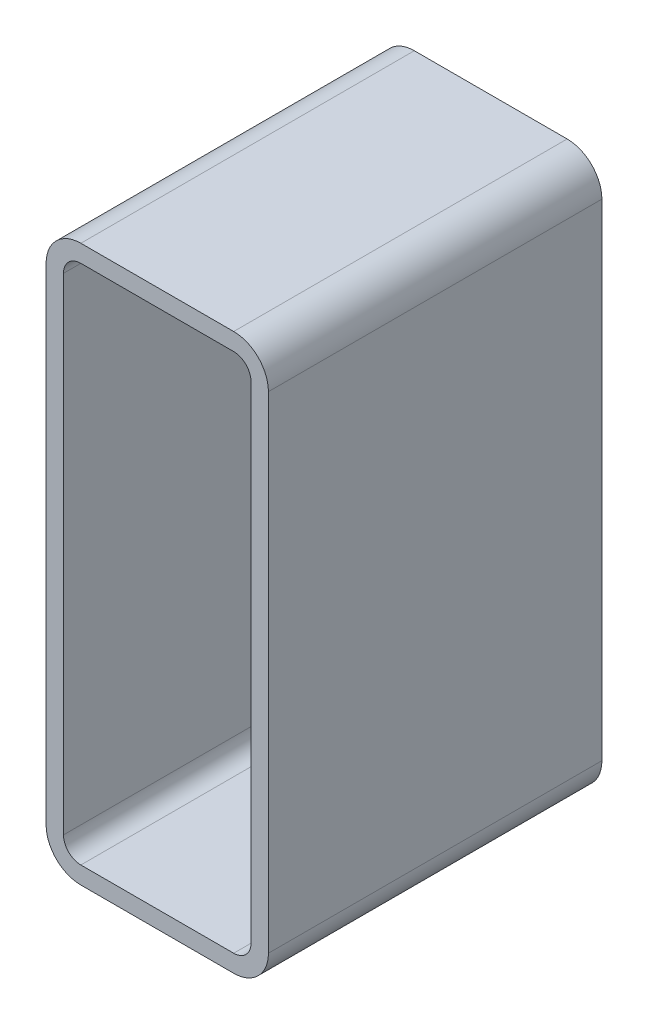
ISO-10303-21;
HEADER;
FILE_DESCRIPTION(('STEP AP214'),'2;1');
FILE_NAME('part.step','',(''),(''),'','','');
FILE_SCHEMA(('AUTOMOTIVE_DESIGN { 1 0 10303 214 1 1 1 1 }'));
ENDSEC;
DATA;
#1=APPLICATION_CONTEXT('core data for automotive mechanical design processes');
#2=APPLICATION_PROTOCOL_DEFINITION('international standard','automotive_design',2000,#1);
#3=PRODUCT_CONTEXT('',#1,'mechanical');
#4=PRODUCT('Part','Part','',(#3));
#5=PRODUCT_RELATED_PRODUCT_CATEGORY('part','',(#4));
#6=PRODUCT_DEFINITION_FORMATION('','',#4);
#7=PRODUCT_DEFINITION_CONTEXT('part definition',#1,'design');
#8=PRODUCT_DEFINITION('design','',#6,#7);
#9=PRODUCT_DEFINITION_SHAPE('','',#8);
#10=(LENGTH_UNIT() NAMED_UNIT(*) SI_UNIT(.MILLI.,.METRE.));
#11=(NAMED_UNIT(*) PLANE_ANGLE_UNIT() SI_UNIT($,.RADIAN.));
#12=(NAMED_UNIT(*) SI_UNIT($,.STERADIAN.) SOLID_ANGLE_UNIT());
#13=UNCERTAINTY_MEASURE_WITH_UNIT(LENGTH_MEASURE(1.E-05),#10,'distance_accuracy_value','');
#14=(GEOMETRIC_REPRESENTATION_CONTEXT(3) GLOBAL_UNCERTAINTY_ASSIGNED_CONTEXT((#13)) GLOBAL_UNIT_ASSIGNED_CONTEXT((#10,
#11,#12)) REPRESENTATION_CONTEXT('',''));
#15=CARTESIAN_POINT('',(0.,0.,0.));
#16=DIRECTION('',(0.,0.,1.));
#17=DIRECTION('',(1.,0.,0.));
#18=AXIS2_PLACEMENT_3D('',#15,#16,#17);
#19=CARTESIAN_POINT('',(172.840940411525,33.4412282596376,304.8));
#20=DIRECTION('',(0.,0.,1.));
#21=DIRECTION('',(1.,0.,0.));
#22=AXIS2_PLACEMENT_3D('',#19,#20,#21);
#23=PLANE('',#22);
#24=CARTESIAN_POINT('',(172.840940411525,33.4412282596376,304.8));
#25=DIRECTION('',(0.,0.,1.));
#26=DIRECTION('',(1.,0.,0.));
#27=AXIS2_PLACEMENT_3D('',#24,#25,#26);
#28=CIRCLE('',#27,31.75);
#29=CARTESIAN_POINT('',(172.840940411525,1.69122825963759,304.8));
#30=VERTEX_POINT('',#29);
#31=CARTESIAN_POINT('',(204.590940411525,33.4412282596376,304.8));
#32=VERTEX_POINT('',#31);
#33=EDGE_CURVE('E211',#30,#32,#28,.T.);
#34=ORIENTED_EDGE('',*,*,#33,.T.);
#35=DIRECTION('',(0.,1.,0.));
#36=VECTOR('',#35,1.);
#37=CARTESIAN_POINT('',(204.590940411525,477.941228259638,304.8));
#38=LINE('',#37,#36);
#39=CARTESIAN_POINT('',(204.590940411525,477.941228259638,304.8));
#40=VERTEX_POINT('',#39);
#41=EDGE_CURVE('E214',#32,#40,#38,.T.);
#42=ORIENTED_EDGE('',*,*,#41,.T.);
#43=CARTESIAN_POINT('',(172.840940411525,477.941228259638,304.8));
#44=DIRECTION('',(0.,0.,1.));
#45=DIRECTION('',(1.,0.,0.));
#46=AXIS2_PLACEMENT_3D('',#43,#44,#45);
#47=CIRCLE('',#46,31.7499999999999);
#48=CARTESIAN_POINT('',(172.840940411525,509.691228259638,304.8));
#49=VERTEX_POINT('',#48);
#50=EDGE_CURVE('E217',#40,#49,#47,.T.);
#51=ORIENTED_EDGE('',*,*,#50,.T.);
#52=DIRECTION('',(-1.,0.,0.));
#53=VECTOR('',#52,1.);
#54=CARTESIAN_POINT('',(33.1409404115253,509.691228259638,304.8));
#55=LINE('',#54,#53);
#56=CARTESIAN_POINT('',(33.1409404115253,509.691228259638,304.8));
#57=VERTEX_POINT('',#56);
#58=EDGE_CURVE('E219',#49,#57,#55,.T.);
#59=ORIENTED_EDGE('',*,*,#58,.T.);
#60=CARTESIAN_POINT('',(33.1409404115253,477.941228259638,304.8));
#61=DIRECTION('',(0.,0.,1.));
#62=DIRECTION('',(1.,0.,0.));
#63=AXIS2_PLACEMENT_3D('',#60,#61,#62);
#64=CIRCLE('',#63,31.7499999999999);
#65=CARTESIAN_POINT('',(1.3909404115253,477.941228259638,304.8));
#66=VERTEX_POINT('',#65);
#67=EDGE_CURVE('E221',#57,#66,#64,.T.);
#68=ORIENTED_EDGE('',*,*,#67,.T.);
#69=DIRECTION('',(0.,-1.,0.));
#70=VECTOR('',#69,1.);
#71=CARTESIAN_POINT('',(1.3909404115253,33.4412282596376,304.8));
#72=LINE('',#71,#70);
#73=CARTESIAN_POINT('',(1.3909404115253,33.4412282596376,304.8));
#74=VERTEX_POINT('',#73);
#75=EDGE_CURVE('E223',#66,#74,#72,.T.);
#76=ORIENTED_EDGE('',*,*,#75,.T.);
#77=CARTESIAN_POINT('',(33.1409404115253,33.4412282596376,304.8));
#78=DIRECTION('',(0.,0.,1.));
#79=DIRECTION('',(1.,0.,0.));
#80=AXIS2_PLACEMENT_3D('',#77,#78,#79);
#81=CIRCLE('',#80,31.75);
#82=CARTESIAN_POINT('',(33.1409404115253,1.69122825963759,304.8));
#83=VERTEX_POINT('',#82);
#84=EDGE_CURVE('E225',#74,#83,#81,.T.);
#85=ORIENTED_EDGE('',*,*,#84,.T.);
#86=DIRECTION('',(1.,0.,0.));
#87=VECTOR('',#86,1.);
#88=CARTESIAN_POINT('',(172.840940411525,1.69122825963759,304.8));
#89=LINE('',#88,#87);
#90=EDGE_CURVE('E227',#83,#30,#89,.T.);
#91=ORIENTED_EDGE('',*,*,#90,.T.);
#92=EDGE_LOOP('',(#34,#42,#51,#59,#68,#76,#85,#91));
#93=FACE_BOUND('',#92,.T.);
#94=DIRECTION('',(0.,-1.,0.));
#95=VECTOR('',#94,1.);
#96=CARTESIAN_POINT('',(17.2659404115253,33.4412282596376,304.8));
#97=LINE('',#96,#95);
#98=CARTESIAN_POINT('',(17.2659404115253,477.941228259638,304.8));
#99=VERTEX_POINT('',#98);
#100=CARTESIAN_POINT('',(17.2659404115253,33.4412282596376,304.8));
#101=VERTEX_POINT('',#100);
#102=EDGE_CURVE('E154',#99,#101,#97,.T.);
#103=ORIENTED_EDGE('',*,*,#102,.F.);
#104=CARTESIAN_POINT('',(33.1409404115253,477.941228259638,304.8));
#105=DIRECTION('',(0.,0.,1.));
#106=DIRECTION('',(1.,0.,0.));
#107=AXIS2_PLACEMENT_3D('',#104,#105,#106);
#108=CIRCLE('',#107,15.8749999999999);
#109=CARTESIAN_POINT('',(33.1409404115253,493.816228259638,304.8));
#110=VERTEX_POINT('',#109);
#111=EDGE_CURVE('E146',#110,#99,#108,.T.);
#112=ORIENTED_EDGE('',*,*,#111,.F.);
#113=DIRECTION('',(-1.,0.,0.));
#114=VECTOR('',#113,1.);
#115=CARTESIAN_POINT('',(33.1409404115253,493.816228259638,304.8));
#116=LINE('',#115,#114);
#117=CARTESIAN_POINT('',(172.840940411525,493.816228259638,304.8));
#118=VERTEX_POINT('',#117);
#119=EDGE_CURVE('E179',#118,#110,#116,.T.);
#120=ORIENTED_EDGE('',*,*,#119,.F.);
#121=CARTESIAN_POINT('',(172.840940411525,477.941228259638,304.8));
#122=DIRECTION('',(0.,0.,1.));
#123=DIRECTION('',(1.,0.,0.));
#124=AXIS2_PLACEMENT_3D('',#121,#122,#123);
#125=CIRCLE('',#124,15.8749999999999);
#126=CARTESIAN_POINT('',(188.715940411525,477.941228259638,304.8));
#127=VERTEX_POINT('',#126);
#128=EDGE_CURVE('E177',#127,#118,#125,.T.);
#129=ORIENTED_EDGE('',*,*,#128,.F.);
#130=DIRECTION('',(0.,1.,0.));
#131=VECTOR('',#130,1.);
#132=CARTESIAN_POINT('',(188.715940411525,477.941228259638,304.8));
#133=LINE('',#132,#131);
#134=CARTESIAN_POINT('',(188.715940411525,33.4412282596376,304.8));
#135=VERTEX_POINT('',#134);
#136=EDGE_CURVE('E175',#135,#127,#133,.T.);
#137=ORIENTED_EDGE('',*,*,#136,.F.);
#138=CARTESIAN_POINT('',(172.840940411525,33.4412282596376,304.8));
#139=DIRECTION('',(0.,0.,1.));
#140=DIRECTION('',(1.,0.,0.));
#141=AXIS2_PLACEMENT_3D('',#138,#139,#140);
#142=CIRCLE('',#141,15.875);
#143=CARTESIAN_POINT('',(172.840940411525,17.5662282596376,304.8));
#144=VERTEX_POINT('',#143);
#145=EDGE_CURVE('E173',#144,#135,#142,.T.);
#146=ORIENTED_EDGE('',*,*,#145,.F.);
#147=DIRECTION('',(1.,0.,0.));
#148=VECTOR('',#147,1.);
#149=CARTESIAN_POINT('',(172.840940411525,17.5662282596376,304.8));
#150=LINE('',#149,#148);
#151=CARTESIAN_POINT('',(33.1409404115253,17.5662282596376,304.8));
#152=VERTEX_POINT('',#151);
#153=EDGE_CURVE('E169',#152,#144,#150,.T.);
#154=ORIENTED_EDGE('',*,*,#153,.F.);
#155=CARTESIAN_POINT('',(33.1409404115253,33.4412282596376,304.8));
#156=DIRECTION('',(0.,0.,1.));
#157=DIRECTION('',(1.,0.,0.));
#158=AXIS2_PLACEMENT_3D('',#155,#156,#157);
#159=CIRCLE('',#158,15.875);
#160=EDGE_CURVE('E167',#101,#152,#159,.T.);
#161=ORIENTED_EDGE('',*,*,#160,.F.);
#162=EDGE_LOOP('',(#103,#112,#120,#129,#137,#146,#154,#161));
#163=FACE_BOUND('',#162,.T.);
#164=ADVANCED_FACE('F33',(#93,#163),#23,.T.);
#165=CARTESIAN_POINT('',(172.840940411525,33.4412282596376,0.));
#166=DIRECTION('',(0.,0.,1.));
#167=DIRECTION('',(1.,0.,0.));
#168=AXIS2_PLACEMENT_3D('',#165,#166,#167);
#169=PLANE('',#168);
#170=CARTESIAN_POINT('',(172.840940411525,33.4412282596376,0.));
#171=DIRECTION('',(0.,0.,1.));
#172=DIRECTION('',(1.,0.,0.));
#173=AXIS2_PLACEMENT_3D('',#170,#171,#172);
#174=CIRCLE('',#173,31.75);
#175=CARTESIAN_POINT('',(172.840940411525,1.69122825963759,0.));
#176=VERTEX_POINT('',#175);
#177=CARTESIAN_POINT('',(204.590940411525,33.4412282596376,0.));
#178=VERTEX_POINT('',#177);
#179=EDGE_CURVE('E162',#176,#178,#174,.T.);
#180=ORIENTED_EDGE('',*,*,#179,.F.);
#181=DIRECTION('',(1.,0.,0.));
#182=VECTOR('',#181,1.);
#183=CARTESIAN_POINT('',(172.840940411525,1.69122825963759,0.));
#184=LINE('',#183,#182);
#185=CARTESIAN_POINT('',(33.1409404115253,1.69122825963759,0.));
#186=VERTEX_POINT('',#185);
#187=EDGE_CURVE('E215',#186,#176,#184,.T.);
#188=ORIENTED_EDGE('',*,*,#187,.F.);
#189=CARTESIAN_POINT('',(33.1409404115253,33.4412282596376,0.));
#190=DIRECTION('',(0.,0.,1.));
#191=DIRECTION('',(1.,0.,0.));
#192=AXIS2_PLACEMENT_3D('',#189,#190,#191);
#193=CIRCLE('',#192,31.75);
#194=CARTESIAN_POINT('',(1.3909404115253,33.4412282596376,0.));
#195=VERTEX_POINT('',#194);
#196=EDGE_CURVE('E242',#195,#186,#193,.T.);
#197=ORIENTED_EDGE('',*,*,#196,.F.);
#198=DIRECTION('',(0.,-1.,0.));
#199=VECTOR('',#198,1.);
#200=CARTESIAN_POINT('',(1.3909404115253,33.4412282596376,0.));
#201=LINE('',#200,#199);
#202=CARTESIAN_POINT('',(1.3909404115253,477.941228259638,0.));
#203=VERTEX_POINT('',#202);
#204=EDGE_CURVE('E240',#203,#195,#201,.T.);
#205=ORIENTED_EDGE('',*,*,#204,.F.);
#206=CARTESIAN_POINT('',(33.1409404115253,477.941228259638,0.));
#207=DIRECTION('',(0.,0.,1.));
#208=DIRECTION('',(1.,0.,0.));
#209=AXIS2_PLACEMENT_3D('',#206,#207,#208);
#210=CIRCLE('',#209,31.7499999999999);
#211=CARTESIAN_POINT('',(33.1409404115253,509.691228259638,0.));
#212=VERTEX_POINT('',#211);
#213=EDGE_CURVE('E238',#212,#203,#210,.T.);
#214=ORIENTED_EDGE('',*,*,#213,.F.);
#215=DIRECTION('',(-1.,0.,0.));
#216=VECTOR('',#215,1.);
#217=CARTESIAN_POINT('',(33.1409404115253,509.691228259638,0.));
#218=LINE('',#217,#216);
#219=CARTESIAN_POINT('',(172.840940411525,509.691228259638,0.));
#220=VERTEX_POINT('',#219);
#221=EDGE_CURVE('E236',#220,#212,#218,.T.);
#222=ORIENTED_EDGE('',*,*,#221,.F.);
#223=CARTESIAN_POINT('',(172.840940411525,477.941228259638,0.));
#224=DIRECTION('',(0.,0.,1.));
#225=DIRECTION('',(1.,0.,0.));
#226=AXIS2_PLACEMENT_3D('',#223,#224,#225);
#227=CIRCLE('',#226,31.7499999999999);
#228=CARTESIAN_POINT('',(204.590940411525,477.941228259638,0.));
#229=VERTEX_POINT('',#228);
#230=EDGE_CURVE('E234',#229,#220,#227,.T.);
#231=ORIENTED_EDGE('',*,*,#230,.F.);
#232=DIRECTION('',(0.,1.,0.));
#233=VECTOR('',#232,1.);
#234=CARTESIAN_POINT('',(204.590940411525,477.941228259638,0.));
#235=LINE('',#234,#233);
#236=EDGE_CURVE('E232',#178,#229,#235,.T.);
#237=ORIENTED_EDGE('',*,*,#236,.F.);
#238=EDGE_LOOP('',(#180,#188,#197,#205,#214,#222,#231,#237));
#239=FACE_BOUND('',#238,.T.);
#240=CARTESIAN_POINT('',(33.1409404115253,477.941228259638,0.));
#241=DIRECTION('',(0.,0.,1.));
#242=DIRECTION('',(1.,0.,0.));
#243=AXIS2_PLACEMENT_3D('',#240,#241,#242);
#244=CIRCLE('',#243,15.8749999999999);
#245=CARTESIAN_POINT('',(33.1409404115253,493.816228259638,0.));
#246=VERTEX_POINT('',#245);
#247=CARTESIAN_POINT('',(17.2659404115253,477.941228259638,0.));
#248=VERTEX_POINT('',#247);
#249=EDGE_CURVE('E56',#246,#248,#244,.T.);
#250=ORIENTED_EDGE('',*,*,#249,.T.);
#251=DIRECTION('',(0.,-1.,0.));
#252=VECTOR('',#251,1.);
#253=CARTESIAN_POINT('',(17.2659404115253,33.4412282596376,0.));
#254=LINE('',#253,#252);
#255=CARTESIAN_POINT('',(17.2659404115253,33.4412282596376,0.));
#256=VERTEX_POINT('',#255);
#257=EDGE_CURVE('E161',#248,#256,#254,.T.);
#258=ORIENTED_EDGE('',*,*,#257,.T.);
#259=CARTESIAN_POINT('',(33.1409404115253,33.4412282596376,0.));
#260=DIRECTION('',(0.,0.,1.));
#261=DIRECTION('',(1.,0.,0.));
#262=AXIS2_PLACEMENT_3D('',#259,#260,#261);
#263=CIRCLE('',#262,15.875);
#264=CARTESIAN_POINT('',(33.1409404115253,17.5662282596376,0.));
#265=VERTEX_POINT('',#264);
#266=EDGE_CURVE('E183',#256,#265,#263,.T.);
#267=ORIENTED_EDGE('',*,*,#266,.T.);
#268=DIRECTION('',(1.,0.,0.));
#269=VECTOR('',#268,1.);
#270=CARTESIAN_POINT('',(172.840940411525,17.5662282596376,0.));
#271=LINE('',#270,#269);
#272=CARTESIAN_POINT('',(172.840940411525,17.5662282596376,0.));
#273=VERTEX_POINT('',#272);
#274=EDGE_CURVE('E186',#265,#273,#271,.T.);
#275=ORIENTED_EDGE('',*,*,#274,.T.);
#276=CARTESIAN_POINT('',(172.840940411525,33.4412282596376,0.));
#277=DIRECTION('',(0.,0.,1.));
#278=DIRECTION('',(1.,0.,0.));
#279=AXIS2_PLACEMENT_3D('',#276,#277,#278);
#280=CIRCLE('',#279,15.875);
#281=CARTESIAN_POINT('',(188.715940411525,33.4412282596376,0.));
#282=VERTEX_POINT('',#281);
#283=EDGE_CURVE('E189',#273,#282,#280,.T.);
#284=ORIENTED_EDGE('',*,*,#283,.T.);
#285=DIRECTION('',(0.,1.,0.));
#286=VECTOR('',#285,1.);
#287=CARTESIAN_POINT('',(188.715940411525,477.941228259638,0.));
#288=LINE('',#287,#286);
#289=CARTESIAN_POINT('',(188.715940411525,477.941228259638,0.));
#290=VERTEX_POINT('',#289);
#291=EDGE_CURVE('E192',#282,#290,#288,.T.);
#292=ORIENTED_EDGE('',*,*,#291,.T.);
#293=CARTESIAN_POINT('',(172.840940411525,477.941228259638,0.));
#294=DIRECTION('',(0.,0.,1.));
#295=DIRECTION('',(1.,0.,0.));
#296=AXIS2_PLACEMENT_3D('',#293,#294,#295);
#297=CIRCLE('',#296,15.8749999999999);
#298=CARTESIAN_POINT('',(172.840940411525,493.816228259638,0.));
#299=VERTEX_POINT('',#298);
#300=EDGE_CURVE('E195',#290,#299,#297,.T.);
#301=ORIENTED_EDGE('',*,*,#300,.T.);
#302=DIRECTION('',(-1.,0.,0.));
#303=VECTOR('',#302,1.);
#304=CARTESIAN_POINT('',(33.1409404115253,493.816228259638,0.));
#305=LINE('',#304,#303);
#306=EDGE_CURVE('E155',#299,#246,#305,.T.);
#307=ORIENTED_EDGE('',*,*,#306,.T.);
#308=EDGE_LOOP('',(#250,#258,#267,#275,#284,#292,#301,#307));
#309=FACE_BOUND('',#308,.T.);
#310=ADVANCED_FACE('F272',(#239,#309),#169,.F.);
#311=CARTESIAN_POINT('',(172.840940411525,33.4412282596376,304.8));
#312=DIRECTION('',(0.,0.,-1.));
#313=DIRECTION('',(-1.,0.,0.));
#314=AXIS2_PLACEMENT_3D('',#311,#312,#313);
#315=CYLINDRICAL_SURFACE('',#314,31.75);
#316=ORIENTED_EDGE('',*,*,#179,.T.);
#317=DIRECTION('',(0.,0.,-1.));
#318=VECTOR('',#317,1.);
#319=CARTESIAN_POINT('',(204.590940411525,33.4412282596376,304.8));
#320=LINE('',#319,#318);
#321=EDGE_CURVE('E11',#32,#178,#320,.T.);
#322=ORIENTED_EDGE('',*,*,#321,.F.);
#323=ORIENTED_EDGE('',*,*,#33,.F.);
#324=DIRECTION('',(0.,0.,-1.));
#325=VECTOR('',#324,1.);
#326=CARTESIAN_POINT('',(172.840940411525,1.69122825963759,304.8));
#327=LINE('',#326,#325);
#328=EDGE_CURVE('E229',#30,#176,#327,.T.);
#329=ORIENTED_EDGE('',*,*,#328,.T.);
#330=EDGE_LOOP('',(#316,#322,#323,#329));
#331=FACE_BOUND('',#330,.T.);
#332=ADVANCED_FACE('F35',(#331),#315,.T.);
#333=CARTESIAN_POINT('',(204.590940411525,477.941228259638,304.8));
#334=DIRECTION('',(-1.,0.,0.));
#335=DIRECTION('',(0.,0.,1.));
#336=AXIS2_PLACEMENT_3D('',#333,#334,#335);
#337=PLANE('',#336);
#338=ORIENTED_EDGE('',*,*,#236,.T.);
#339=DIRECTION('',(0.,0.,-1.));
#340=VECTOR('',#339,1.);
#341=CARTESIAN_POINT('',(204.590940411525,477.941228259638,304.8));
#342=LINE('',#341,#340);
#343=EDGE_CURVE('E41',#40,#229,#342,.T.);
#344=ORIENTED_EDGE('',*,*,#343,.F.);
#345=ORIENTED_EDGE('',*,*,#41,.F.);
#346=ORIENTED_EDGE('',*,*,#321,.T.);
#347=EDGE_LOOP('',(#338,#344,#345,#346));
#348=FACE_BOUND('',#347,.T.);
#349=ADVANCED_FACE('F289',(#348),#337,.F.);
#350=CARTESIAN_POINT('',(172.840940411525,477.941228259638,304.8));
#351=DIRECTION('',(0.,0.,-1.));
#352=DIRECTION('',(-1.,0.,0.));
#353=AXIS2_PLACEMENT_3D('',#350,#351,#352);
#354=CYLINDRICAL_SURFACE('',#353,31.7499999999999);
#355=ORIENTED_EDGE('',*,*,#230,.T.);
#356=DIRECTION('',(0.,0.,-1.));
#357=VECTOR('',#356,1.);
#358=CARTESIAN_POINT('',(172.840940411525,509.691228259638,304.8));
#359=LINE('',#358,#357);
#360=EDGE_CURVE('E259',#49,#220,#359,.T.);
#361=ORIENTED_EDGE('',*,*,#360,.F.);
#362=ORIENTED_EDGE('',*,*,#50,.F.);
#363=ORIENTED_EDGE('',*,*,#343,.T.);
#364=EDGE_LOOP('',(#355,#361,#362,#363));
#365=FACE_BOUND('',#364,.T.);
#366=ADVANCED_FACE('F266',(#365),#354,.T.);
#367=CARTESIAN_POINT('',(33.1409404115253,509.691228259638,304.8));
#368=DIRECTION('',(0.,-1.,0.));
#369=DIRECTION('',(0.,0.,-1.));
#370=AXIS2_PLACEMENT_3D('',#367,#368,#369);
#371=PLANE('',#370);
#372=ORIENTED_EDGE('',*,*,#221,.T.);
#373=DIRECTION('',(0.,0.,-1.));
#374=VECTOR('',#373,1.);
#375=CARTESIAN_POINT('',(33.1409404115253,509.691228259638,304.8));
#376=LINE('',#375,#374);
#377=EDGE_CURVE('E256',#57,#212,#376,.T.);
#378=ORIENTED_EDGE('',*,*,#377,.F.);
#379=ORIENTED_EDGE('',*,*,#58,.F.);
#380=ORIENTED_EDGE('',*,*,#360,.T.);
#381=EDGE_LOOP('',(#372,#378,#379,#380));
#382=FACE_BOUND('',#381,.T.);
#383=ADVANCED_FACE('F278',(#382),#371,.F.);
#384=CARTESIAN_POINT('',(33.1409404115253,477.941228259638,304.8));
#385=DIRECTION('',(0.,0.,-1.));
#386=DIRECTION('',(-1.,0.,0.));
#387=AXIS2_PLACEMENT_3D('',#384,#385,#386);
#388=CYLINDRICAL_SURFACE('',#387,31.7499999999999);
#389=ORIENTED_EDGE('',*,*,#213,.T.);
#390=DIRECTION('',(0.,0.,-1.));
#391=VECTOR('',#390,1.);
#392=CARTESIAN_POINT('',(1.3909404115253,477.941228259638,304.8));
#393=LINE('',#392,#391);
#394=EDGE_CURVE('E253',#66,#203,#393,.T.);
#395=ORIENTED_EDGE('',*,*,#394,.F.);
#396=ORIENTED_EDGE('',*,*,#67,.F.);
#397=ORIENTED_EDGE('',*,*,#377,.T.);
#398=EDGE_LOOP('',(#389,#395,#396,#397));
#399=FACE_BOUND('',#398,.T.);
#400=ADVANCED_FACE('F282',(#399),#388,.T.);
#401=CARTESIAN_POINT('',(1.3909404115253,33.4412282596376,304.8));
#402=DIRECTION('',(1.,0.,0.));
#403=DIRECTION('',(0.,0.,-1.));
#404=AXIS2_PLACEMENT_3D('',#401,#402,#403);
#405=PLANE('',#404);
#406=ORIENTED_EDGE('',*,*,#204,.T.);
#407=DIRECTION('',(0.,0.,-1.));
#408=VECTOR('',#407,1.);
#409=CARTESIAN_POINT('',(1.3909404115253,33.4412282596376,304.8));
#410=LINE('',#409,#408);
#411=EDGE_CURVE('E250',#74,#195,#410,.T.);
#412=ORIENTED_EDGE('',*,*,#411,.F.);
#413=ORIENTED_EDGE('',*,*,#75,.F.);
#414=ORIENTED_EDGE('',*,*,#394,.T.);
#415=EDGE_LOOP('',(#406,#412,#413,#414));
#416=FACE_BOUND('',#415,.T.);
#417=ADVANCED_FACE('F302',(#416),#405,.F.);
#418=CARTESIAN_POINT('',(33.1409404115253,33.4412282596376,304.8));
#419=DIRECTION('',(0.,0.,-1.));
#420=DIRECTION('',(-1.,0.,0.));
#421=AXIS2_PLACEMENT_3D('',#418,#419,#420);
#422=CYLINDRICAL_SURFACE('',#421,31.75);
#423=ORIENTED_EDGE('',*,*,#196,.T.);
#424=DIRECTION('',(0.,0.,-1.));
#425=VECTOR('',#424,1.);
#426=CARTESIAN_POINT('',(33.1409404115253,1.69122825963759,304.8));
#427=LINE('',#426,#425);
#428=EDGE_CURVE('E247',#83,#186,#427,.T.);
#429=ORIENTED_EDGE('',*,*,#428,.F.);
#430=ORIENTED_EDGE('',*,*,#84,.F.);
#431=ORIENTED_EDGE('',*,*,#411,.T.);
#432=EDGE_LOOP('',(#423,#429,#430,#431));
#433=FACE_BOUND('',#432,.T.);
#434=ADVANCED_FACE('F300',(#433),#422,.T.);
#435=CARTESIAN_POINT('',(172.840940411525,1.69122825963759,304.8));
#436=DIRECTION('',(0.,1.,0.));
#437=DIRECTION('',(0.,0.,1.));
#438=AXIS2_PLACEMENT_3D('',#435,#436,#437);
#439=PLANE('',#438);
#440=ORIENTED_EDGE('',*,*,#187,.T.);
#441=ORIENTED_EDGE('',*,*,#328,.F.);
#442=ORIENTED_EDGE('',*,*,#90,.F.);
#443=ORIENTED_EDGE('',*,*,#428,.T.);
#444=EDGE_LOOP('',(#440,#441,#442,#443));
#445=FACE_BOUND('',#444,.T.);
#446=ADVANCED_FACE('F295',(#445),#439,.F.);
#447=CARTESIAN_POINT('',(33.1409404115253,477.941228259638,304.8));
#448=DIRECTION('',(0.,0.,-1.));
#449=DIRECTION('',(-1.,0.,0.));
#450=AXIS2_PLACEMENT_3D('',#447,#448,#449);
#451=CYLINDRICAL_SURFACE('',#450,15.8749999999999);
#452=ORIENTED_EDGE('',*,*,#249,.F.);
#453=DIRECTION('',(0.,0.,-1.));
#454=VECTOR('',#453,1.);
#455=CARTESIAN_POINT('',(33.1409404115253,493.816228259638,304.8));
#456=LINE('',#455,#454);
#457=EDGE_CURVE('E150',#110,#246,#456,.T.);
#458=ORIENTED_EDGE('',*,*,#457,.F.);
#459=ORIENTED_EDGE('',*,*,#111,.T.);
#460=DIRECTION('',(0.,0.,-1.));
#461=VECTOR('',#460,1.);
#462=CARTESIAN_POINT('',(17.2659404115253,477.941228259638,304.8));
#463=LINE('',#462,#461);
#464=EDGE_CURVE('E149',#99,#248,#463,.T.);
#465=ORIENTED_EDGE('',*,*,#464,.T.);
#466=EDGE_LOOP('',(#452,#458,#459,#465));
#467=FACE_BOUND('',#466,.T.);
#468=ADVANCED_FACE('F148',(#467),#451,.F.);
#469=CARTESIAN_POINT('',(17.2659404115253,33.4412282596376,304.8));
#470=DIRECTION('',(1.,0.,0.));
#471=DIRECTION('',(0.,0.,-1.));
#472=AXIS2_PLACEMENT_3D('',#469,#470,#471);
#473=PLANE('',#472);
#474=ORIENTED_EDGE('',*,*,#257,.F.);
#475=ORIENTED_EDGE('',*,*,#464,.F.);
#476=ORIENTED_EDGE('',*,*,#102,.T.);
#477=DIRECTION('',(0.,0.,-1.));
#478=VECTOR('',#477,1.);
#479=CARTESIAN_POINT('',(17.2659404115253,33.4412282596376,304.8));
#480=LINE('',#479,#478);
#481=EDGE_CURVE('E163',#101,#256,#480,.T.);
#482=ORIENTED_EDGE('',*,*,#481,.T.);
#483=EDGE_LOOP('',(#474,#475,#476,#482));
#484=FACE_BOUND('',#483,.T.);
#485=ADVANCED_FACE('F158',(#484),#473,.T.);
#486=CARTESIAN_POINT('',(33.1409404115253,33.4412282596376,304.8));
#487=DIRECTION('',(0.,0.,-1.));
#488=DIRECTION('',(-1.,0.,0.));
#489=AXIS2_PLACEMENT_3D('',#486,#487,#488);
#490=CYLINDRICAL_SURFACE('',#489,15.875);
#491=ORIENTED_EDGE('',*,*,#266,.F.);
#492=ORIENTED_EDGE('',*,*,#481,.F.);
#493=ORIENTED_EDGE('',*,*,#160,.T.);
#494=DIRECTION('',(0.,0.,-1.));
#495=VECTOR('',#494,1.);
#496=CARTESIAN_POINT('',(33.1409404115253,17.5662282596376,304.8));
#497=LINE('',#496,#495);
#498=EDGE_CURVE('E208',#152,#265,#497,.T.);
#499=ORIENTED_EDGE('',*,*,#498,.T.);
#500=EDGE_LOOP('',(#491,#492,#493,#499));
#501=FACE_BOUND('',#500,.T.);
#502=ADVANCED_FACE('F327',(#501),#490,.F.);
#503=CARTESIAN_POINT('',(172.840940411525,17.5662282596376,304.8));
#504=DIRECTION('',(0.,1.,0.));
#505=DIRECTION('',(0.,0.,1.));
#506=AXIS2_PLACEMENT_3D('',#503,#504,#505);
#507=PLANE('',#506);
#508=ORIENTED_EDGE('',*,*,#274,.F.);
#509=ORIENTED_EDGE('',*,*,#498,.F.);
#510=ORIENTED_EDGE('',*,*,#153,.T.);
#511=DIRECTION('',(0.,0.,-1.));
#512=VECTOR('',#511,1.);
#513=CARTESIAN_POINT('',(172.840940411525,17.5662282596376,304.8));
#514=LINE('',#513,#512);
#515=EDGE_CURVE('E206',#144,#273,#514,.T.);
#516=ORIENTED_EDGE('',*,*,#515,.T.);
#517=EDGE_LOOP('',(#508,#509,#510,#516));
#518=FACE_BOUND('',#517,.T.);
#519=ADVANCED_FACE('F331',(#518),#507,.T.);
#520=CARTESIAN_POINT('',(172.840940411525,33.4412282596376,304.8));
#521=DIRECTION('',(0.,0.,-1.));
#522=DIRECTION('',(-1.,0.,0.));
#523=AXIS2_PLACEMENT_3D('',#520,#521,#522);
#524=CYLINDRICAL_SURFACE('',#523,15.875);
#525=ORIENTED_EDGE('',*,*,#283,.F.);
#526=ORIENTED_EDGE('',*,*,#515,.F.);
#527=ORIENTED_EDGE('',*,*,#145,.T.);
#528=DIRECTION('',(0.,0.,-1.));
#529=VECTOR('',#528,1.);
#530=CARTESIAN_POINT('',(188.715940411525,33.4412282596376,304.8));
#531=LINE('',#530,#529);
#532=EDGE_CURVE('E204',#135,#282,#531,.T.);
#533=ORIENTED_EDGE('',*,*,#532,.T.);
#534=EDGE_LOOP('',(#525,#526,#527,#533));
#535=FACE_BOUND('',#534,.T.);
#536=ADVANCED_FACE('F337',(#535),#524,.F.);
#537=CARTESIAN_POINT('',(188.715940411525,477.941228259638,304.8));
#538=DIRECTION('',(-1.,0.,0.));
#539=DIRECTION('',(0.,0.,1.));
#540=AXIS2_PLACEMENT_3D('',#537,#538,#539);
#541=PLANE('',#540);
#542=ORIENTED_EDGE('',*,*,#291,.F.);
#543=ORIENTED_EDGE('',*,*,#532,.F.);
#544=ORIENTED_EDGE('',*,*,#136,.T.);
#545=DIRECTION('',(0.,0.,-1.));
#546=VECTOR('',#545,1.);
#547=CARTESIAN_POINT('',(188.715940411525,477.941228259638,304.8));
#548=LINE('',#547,#546);
#549=EDGE_CURVE('E202',#127,#290,#548,.T.);
#550=ORIENTED_EDGE('',*,*,#549,.T.);
#551=EDGE_LOOP('',(#542,#543,#544,#550));
#552=FACE_BOUND('',#551,.T.);
#553=ADVANCED_FACE('F341',(#552),#541,.T.);
#554=CARTESIAN_POINT('',(172.840940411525,477.941228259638,304.8));
#555=DIRECTION('',(0.,0.,-1.));
#556=DIRECTION('',(-1.,0.,0.));
#557=AXIS2_PLACEMENT_3D('',#554,#555,#556);
#558=CYLINDRICAL_SURFACE('',#557,15.8749999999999);
#559=ORIENTED_EDGE('',*,*,#300,.F.);
#560=ORIENTED_EDGE('',*,*,#549,.F.);
#561=ORIENTED_EDGE('',*,*,#128,.T.);
#562=DIRECTION('',(0.,0.,-1.));
#563=VECTOR('',#562,1.);
#564=CARTESIAN_POINT('',(172.840940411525,493.816228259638,304.8));
#565=LINE('',#564,#563);
#566=EDGE_CURVE('E48',#118,#299,#565,.T.);
#567=ORIENTED_EDGE('',*,*,#566,.T.);
#568=EDGE_LOOP('',(#559,#560,#561,#567));
#569=FACE_BOUND('',#568,.T.);
#570=ADVANCED_FACE('F345',(#569),#558,.F.);
#571=CARTESIAN_POINT('',(33.1409404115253,493.816228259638,304.8));
#572=DIRECTION('',(0.,-1.,0.));
#573=DIRECTION('',(0.,0.,-1.));
#574=AXIS2_PLACEMENT_3D('',#571,#572,#573);
#575=PLANE('',#574);
#576=ORIENTED_EDGE('',*,*,#306,.F.);
#577=ORIENTED_EDGE('',*,*,#566,.F.);
#578=ORIENTED_EDGE('',*,*,#119,.T.);
#579=ORIENTED_EDGE('',*,*,#457,.T.);
#580=EDGE_LOOP('',(#576,#577,#578,#579));
#581=FACE_BOUND('',#580,.T.);
#582=ADVANCED_FACE('F349',(#581),#575,.T.);
#583=CLOSED_SHELL('',(#164,#310,#332,#349,#366,#383,#400,#417,#434,#446,#468,#485,#502,#519,
#536,#553,#570,#582));
#584=MANIFOLD_SOLID_BREP('B2',#583);
#585=ADVANCED_BREP_SHAPE_REPRESENTATION('',(#18,#584),#14);
#586=SHAPE_DEFINITION_REPRESENTATION(#9,#585);
ENDSEC;
END-ISO-10303-21;
